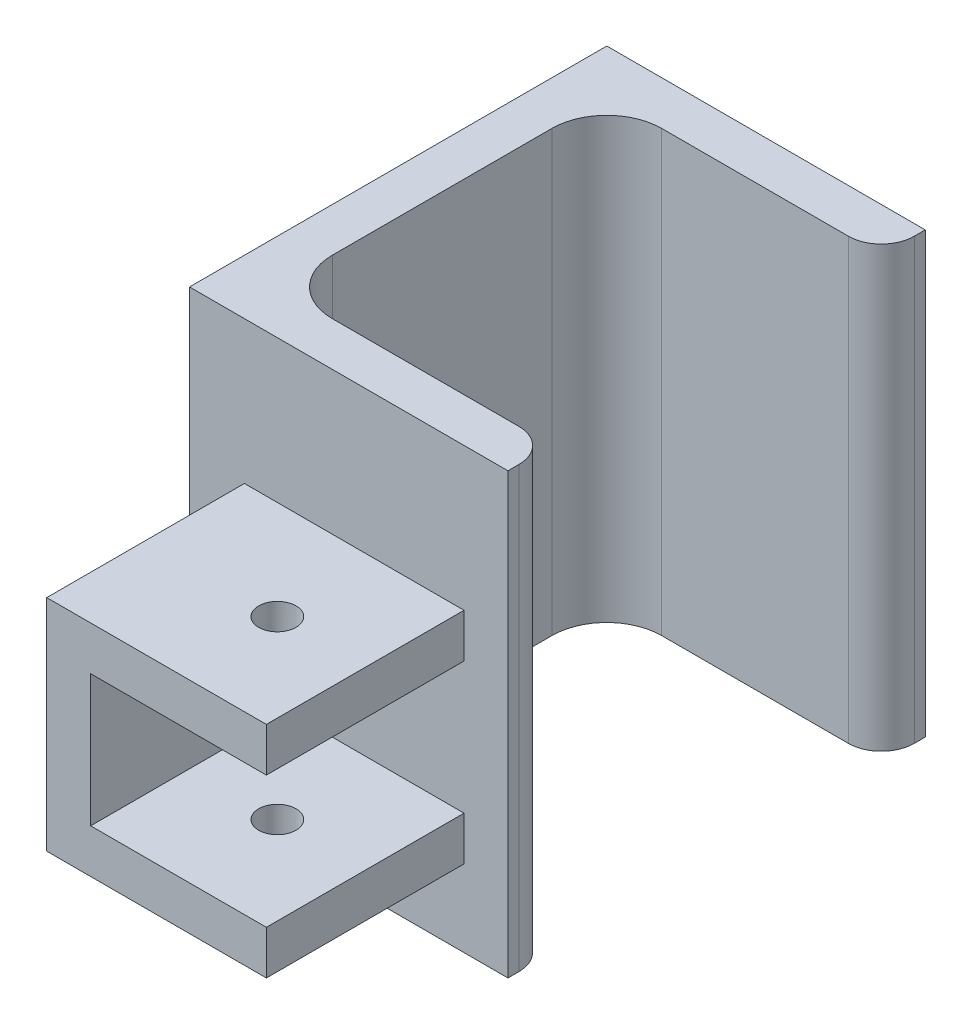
ISO-10303-21;
HEADER;
FILE_DESCRIPTION(('STEP AP214'),'2;1');
FILE_NAME('part.step','',(''),(''),'','','');
FILE_SCHEMA(('AUTOMOTIVE_DESIGN { 1 0 10303 214 1 1 1 1 }'));
ENDSEC;
DATA;
#1=APPLICATION_CONTEXT('core data for automotive mechanical design processes');
#2=APPLICATION_PROTOCOL_DEFINITION('international standard','automotive_design',2000,#1);
#3=PRODUCT_CONTEXT('',#1,'mechanical');
#4=PRODUCT('Part','Part','',(#3));
#5=PRODUCT_RELATED_PRODUCT_CATEGORY('part','',(#4));
#6=PRODUCT_DEFINITION_FORMATION('','',#4);
#7=PRODUCT_DEFINITION_CONTEXT('part definition',#1,'design');
#8=PRODUCT_DEFINITION('design','',#6,#7);
#9=PRODUCT_DEFINITION_SHAPE('','',#8);
#10=(LENGTH_UNIT() NAMED_UNIT(*) SI_UNIT(.MILLI.,.METRE.));
#11=(NAMED_UNIT(*) PLANE_ANGLE_UNIT() SI_UNIT($,.RADIAN.));
#12=(NAMED_UNIT(*) SI_UNIT($,.STERADIAN.) SOLID_ANGLE_UNIT());
#13=UNCERTAINTY_MEASURE_WITH_UNIT(LENGTH_MEASURE(1.E-05),#10,'distance_accuracy_value','');
#14=(GEOMETRIC_REPRESENTATION_CONTEXT(3) GLOBAL_UNCERTAINTY_ASSIGNED_CONTEXT((#13)) GLOBAL_UNIT_ASSIGNED_CONTEXT((#10,
#11,#12)) REPRESENTATION_CONTEXT('',''));
#15=CARTESIAN_POINT('',(0.,0.,0.));
#16=DIRECTION('',(0.,0.,1.));
#17=DIRECTION('',(1.,0.,0.));
#18=AXIS2_PLACEMENT_3D('',#15,#16,#17);
#19=CARTESIAN_POINT('',(25.,6.99999999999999,37.));
#20=DIRECTION('',(-1.,0.,0.));
#21=DIRECTION('',(0.,-1.,0.));
#22=AXIS2_PLACEMENT_3D('',#19,#20,#21);
#23=PLANE('',#22);
#24=DIRECTION('',(0.,0.,1.));
#25=VECTOR('',#24,1.);
#26=CARTESIAN_POINT('',(25.,2.99999999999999,19.));
#27=LINE('',#26,#25);
#28=CARTESIAN_POINT('',(25.,2.99999999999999,19.));
#29=VERTEX_POINT('',#28);
#30=CARTESIAN_POINT('',(25.,2.99999999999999,37.));
#31=VERTEX_POINT('',#30);
#32=EDGE_CURVE('E214',#29,#31,#27,.T.);
#33=ORIENTED_EDGE('',*,*,#32,.F.);
#34=DIRECTION('',(0.,1.,0.));
#35=VECTOR('',#34,1.);
#36=CARTESIAN_POINT('',(25.,6.99999999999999,19.));
#37=LINE('',#36,#35);
#38=CARTESIAN_POINT('',(25.,6.99999999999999,19.));
#39=VERTEX_POINT('',#38);
#40=EDGE_CURVE('E233',#29,#39,#37,.T.);
#41=ORIENTED_EDGE('',*,*,#40,.T.);
#42=DIRECTION('',(0.,0.,-1.));
#43=VECTOR('',#42,1.);
#44=CARTESIAN_POINT('',(25.,6.99999999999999,37.));
#45=LINE('',#44,#43);
#46=CARTESIAN_POINT('',(25.,6.99999999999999,37.));
#47=VERTEX_POINT('',#46);
#48=EDGE_CURVE('E240',#47,#39,#45,.T.);
#49=ORIENTED_EDGE('',*,*,#48,.F.);
#50=DIRECTION('',(0.,1.,0.));
#51=VECTOR('',#50,1.);
#52=CARTESIAN_POINT('',(25.,6.99999999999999,37.));
#53=LINE('',#52,#51);
#54=EDGE_CURVE('E219',#31,#47,#53,.T.);
#55=ORIENTED_EDGE('',*,*,#54,.F.);
#56=EDGE_LOOP('',(#33,#41,#49,#55));
#57=FACE_BOUND('',#56,.T.);
#58=ADVANCED_FACE('F39',(#57),#23,.F.);
#59=CARTESIAN_POINT('',(4.,20.,15.));
#60=DIRECTION('',(0.,-1.,0.));
#61=DIRECTION('',(0.,0.,-1.));
#62=AXIS2_PLACEMENT_3D('',#59,#60,#61);
#63=PLANE('',#62);
#64=DIRECTION('',(0.,0.,-1.));
#65=VECTOR('',#64,1.);
#66=CARTESIAN_POINT('',(29.,20.,19.));
#67=LINE('',#66,#65);
#68=CARTESIAN_POINT('',(29.,20.,19.));
#69=VERTEX_POINT('',#68);
#70=CARTESIAN_POINT('',(29.,20.,18.));
#71=VERTEX_POINT('',#70);
#72=EDGE_CURVE('E278',#69,#71,#67,.T.);
#73=ORIENTED_EDGE('',*,*,#72,.T.);
#74=CARTESIAN_POINT('',(26.,20.,18.));
#75=DIRECTION('',(0.,-1.,0.));
#76=DIRECTION('',(0.,0.,-1.));
#77=AXIS2_PLACEMENT_3D('',#74,#75,#76);
#78=CIRCLE('',#77,3.);
#79=CARTESIAN_POINT('',(26.,20.,15.));
#80=VERTEX_POINT('',#79);
#81=EDGE_CURVE('E325',#71,#80,#78,.F.);
#82=ORIENTED_EDGE('',*,*,#81,.T.);
#83=DIRECTION('',(-1.,0.,0.));
#84=VECTOR('',#83,1.);
#85=CARTESIAN_POINT('',(0.,20.,15.));
#86=LINE('',#85,#84);
#87=CARTESIAN_POINT('',(9.,20.,15.));
#88=VERTEX_POINT('',#87);
#89=EDGE_CURVE('E275',#80,#88,#86,.T.);
#90=ORIENTED_EDGE('',*,*,#89,.T.);
#91=CARTESIAN_POINT('',(9.,20.,9.99999999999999));
#92=DIRECTION('',(0.,-1.,0.));
#93=DIRECTION('',(0.,0.,-1.));
#94=AXIS2_PLACEMENT_3D('',#91,#92,#93);
#95=CIRCLE('',#94,5.);
#96=CARTESIAN_POINT('',(4.,20.,9.99999999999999));
#97=VERTEX_POINT('',#96);
#98=EDGE_CURVE('E315',#88,#97,#95,.T.);
#99=ORIENTED_EDGE('',*,*,#98,.T.);
#100=DIRECTION('',(0.,0.,1.));
#101=VECTOR('',#100,1.);
#102=CARTESIAN_POINT('',(4.,20.,15.));
#103=LINE('',#102,#101);
#104=CARTESIAN_POINT('',(4.,20.,-10.));
#105=VERTEX_POINT('',#104);
#106=EDGE_CURVE('E287',#105,#97,#103,.T.);
#107=ORIENTED_EDGE('',*,*,#106,.F.);
#108=CARTESIAN_POINT('',(9.,20.,-10.));
#109=DIRECTION('',(0.,-1.,0.));
#110=DIRECTION('',(0.,0.,-1.));
#111=AXIS2_PLACEMENT_3D('',#108,#109,#110);
#112=CIRCLE('',#111,5.);
#113=CARTESIAN_POINT('',(9.,20.,-15.));
#114=VERTEX_POINT('',#113);
#115=EDGE_CURVE('E313',#105,#114,#112,.T.);
#116=ORIENTED_EDGE('',*,*,#115,.T.);
#117=DIRECTION('',(1.,0.,0.));
#118=VECTOR('',#117,1.);
#119=CARTESIAN_POINT('',(0.,20.,-15.));
#120=LINE('',#119,#118);
#121=CARTESIAN_POINT('',(26.,20.,-15.));
#122=VERTEX_POINT('',#121);
#123=EDGE_CURVE('E246',#114,#122,#120,.T.);
#124=ORIENTED_EDGE('',*,*,#123,.T.);
#125=CARTESIAN_POINT('',(26.,20.,-18.));
#126=DIRECTION('',(0.,-1.,0.));
#127=DIRECTION('',(0.,0.,-1.));
#128=AXIS2_PLACEMENT_3D('',#125,#126,#127);
#129=CIRCLE('',#128,3.);
#130=CARTESIAN_POINT('',(29.,20.,-18.));
#131=VERTEX_POINT('',#130);
#132=EDGE_CURVE('E324',#122,#131,#129,.F.);
#133=ORIENTED_EDGE('',*,*,#132,.T.);
#134=DIRECTION('',(0.,0.,1.));
#135=VECTOR('',#134,1.);
#136=CARTESIAN_POINT('',(29.,20.,-19.));
#137=LINE('',#136,#135);
#138=CARTESIAN_POINT('',(29.,20.,-19.));
#139=VERTEX_POINT('',#138);
#140=EDGE_CURVE('E262',#139,#131,#137,.T.);
#141=ORIENTED_EDGE('',*,*,#140,.F.);
#142=DIRECTION('',(1.,0.,0.));
#143=VECTOR('',#142,1.);
#144=CARTESIAN_POINT('',(0.,20.,-19.));
#145=LINE('',#144,#143);
#146=CARTESIAN_POINT('',(0.,20.,-19.));
#147=VERTEX_POINT('',#146);
#148=EDGE_CURVE('E249',#147,#139,#145,.T.);
#149=ORIENTED_EDGE('',*,*,#148,.F.);
#150=DIRECTION('',(0.,0.,1.));
#151=VECTOR('',#150,1.);
#152=CARTESIAN_POINT('',(0.,20.,15.));
#153=LINE('',#152,#151);
#154=CARTESIAN_POINT('',(0.,20.,19.));
#155=VERTEX_POINT('',#154);
#156=EDGE_CURVE('E288',#147,#155,#153,.T.);
#157=ORIENTED_EDGE('',*,*,#156,.T.);
#158=DIRECTION('',(-1.,0.,0.));
#159=VECTOR('',#158,1.);
#160=CARTESIAN_POINT('',(0.,20.,19.));
#161=LINE('',#160,#159);
#162=EDGE_CURVE('E279',#69,#155,#161,.T.);
#163=ORIENTED_EDGE('',*,*,#162,.F.);
#164=EDGE_LOOP('',(#73,#82,#90,#99,#107,#116,#124,#133,#141,#149,#157,#163));
#165=FACE_BOUND('',#164,.T.);
#166=ADVANCED_FACE('F352',(#165),#63,.F.);
#167=CARTESIAN_POINT('',(4.,-20.,15.));
#168=DIRECTION('',(0.,1.,0.));
#169=DIRECTION('',(0.,0.,1.));
#170=AXIS2_PLACEMENT_3D('',#167,#168,#169);
#171=PLANE('',#170);
#172=DIRECTION('',(1.,0.,0.));
#173=VECTOR('',#172,1.);
#174=CARTESIAN_POINT('',(0.,-20.,15.));
#175=LINE('',#174,#173);
#176=CARTESIAN_POINT('',(9.,-20.,15.));
#177=VERTEX_POINT('',#176);
#178=CARTESIAN_POINT('',(26.,-20.,15.));
#179=VERTEX_POINT('',#178);
#180=EDGE_CURVE('E270',#177,#179,#175,.T.);
#181=ORIENTED_EDGE('',*,*,#180,.T.);
#182=CARTESIAN_POINT('',(26.,-20.,18.));
#183=DIRECTION('',(0.,1.,0.));
#184=DIRECTION('',(0.,0.,1.));
#185=AXIS2_PLACEMENT_3D('',#182,#183,#184);
#186=CIRCLE('',#185,3.);
#187=CARTESIAN_POINT('',(29.,-20.,18.));
#188=VERTEX_POINT('',#187);
#189=EDGE_CURVE('E327',#179,#188,#186,.F.);
#190=ORIENTED_EDGE('',*,*,#189,.T.);
#191=DIRECTION('',(0.,0.,-1.));
#192=VECTOR('',#191,1.);
#193=CARTESIAN_POINT('',(29.,-20.,19.));
#194=LINE('',#193,#192);
#195=CARTESIAN_POINT('',(29.,-20.,19.));
#196=VERTEX_POINT('',#195);
#197=EDGE_CURVE('E284',#196,#188,#194,.T.);
#198=ORIENTED_EDGE('',*,*,#197,.F.);
#199=DIRECTION('',(1.,0.,0.));
#200=VECTOR('',#199,1.);
#201=CARTESIAN_POINT('',(0.,-20.,19.));
#202=LINE('',#201,#200);
#203=CARTESIAN_POINT('',(0.,-20.,19.));
#204=VERTEX_POINT('',#203);
#205=EDGE_CURVE('E272',#204,#196,#202,.T.);
#206=ORIENTED_EDGE('',*,*,#205,.F.);
#207=DIRECTION('',(0.,0.,-1.));
#208=VECTOR('',#207,1.);
#209=CARTESIAN_POINT('',(0.,-20.,15.));
#210=LINE('',#209,#208);
#211=CARTESIAN_POINT('',(0.,-20.,-19.));
#212=VERTEX_POINT('',#211);
#213=EDGE_CURVE('E291',#204,#212,#210,.T.);
#214=ORIENTED_EDGE('',*,*,#213,.T.);
#215=DIRECTION('',(-1.,0.,0.));
#216=VECTOR('',#215,1.);
#217=CARTESIAN_POINT('',(0.,-20.,-19.));
#218=LINE('',#217,#216);
#219=CARTESIAN_POINT('',(29.,-20.,-19.));
#220=VERTEX_POINT('',#219);
#221=EDGE_CURVE('E253',#220,#212,#218,.T.);
#222=ORIENTED_EDGE('',*,*,#221,.F.);
#223=DIRECTION('',(0.,0.,1.));
#224=VECTOR('',#223,1.);
#225=CARTESIAN_POINT('',(29.,-20.,-19.));
#226=LINE('',#225,#224);
#227=CARTESIAN_POINT('',(29.,-20.,-18.));
#228=VERTEX_POINT('',#227);
#229=EDGE_CURVE('E260',#220,#228,#226,.T.);
#230=ORIENTED_EDGE('',*,*,#229,.T.);
#231=CARTESIAN_POINT('',(26.,-20.,-18.));
#232=DIRECTION('',(0.,1.,0.));
#233=DIRECTION('',(0.,0.,1.));
#234=AXIS2_PLACEMENT_3D('',#231,#232,#233);
#235=CIRCLE('',#234,3.);
#236=CARTESIAN_POINT('',(26.,-20.,-15.));
#237=VERTEX_POINT('',#236);
#238=EDGE_CURVE('E330',#228,#237,#235,.F.);
#239=ORIENTED_EDGE('',*,*,#238,.T.);
#240=DIRECTION('',(-1.,0.,0.));
#241=VECTOR('',#240,1.);
#242=CARTESIAN_POINT('',(0.,-20.,-15.));
#243=LINE('',#242,#241);
#244=CARTESIAN_POINT('',(9.,-20.,-15.));
#245=VERTEX_POINT('',#244);
#246=EDGE_CURVE('E252',#237,#245,#243,.T.);
#247=ORIENTED_EDGE('',*,*,#246,.T.);
#248=CARTESIAN_POINT('',(9.,-20.,-10.));
#249=DIRECTION('',(0.,1.,0.));
#250=DIRECTION('',(0.,0.,1.));
#251=AXIS2_PLACEMENT_3D('',#248,#249,#250);
#252=CIRCLE('',#251,5.);
#253=CARTESIAN_POINT('',(4.,-20.,-9.99999999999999));
#254=VERTEX_POINT('',#253);
#255=EDGE_CURVE('E317',#245,#254,#252,.T.);
#256=ORIENTED_EDGE('',*,*,#255,.T.);
#257=DIRECTION('',(0.,0.,-1.));
#258=VECTOR('',#257,1.);
#259=CARTESIAN_POINT('',(4.,-20.,15.));
#260=LINE('',#259,#258);
#261=CARTESIAN_POINT('',(4.,-20.,10.));
#262=VERTEX_POINT('',#261);
#263=EDGE_CURVE('E292',#262,#254,#260,.T.);
#264=ORIENTED_EDGE('',*,*,#263,.F.);
#265=CARTESIAN_POINT('',(9.,-20.,9.99999999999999));
#266=DIRECTION('',(0.,1.,0.));
#267=DIRECTION('',(0.,0.,1.));
#268=AXIS2_PLACEMENT_3D('',#265,#266,#267);
#269=CIRCLE('',#268,5.);
#270=EDGE_CURVE('E309',#262,#177,#269,.T.);
#271=ORIENTED_EDGE('',*,*,#270,.T.);
#272=EDGE_LOOP('',(#181,#190,#198,#206,#214,#222,#230,#239,#247,#256,#264,#271));
#273=FACE_BOUND('',#272,.T.);
#274=ADVANCED_FACE('F341',(#273),#171,.F.);
#275=CARTESIAN_POINT('',(4.,0.,0.));
#276=DIRECTION('',(1.,0.,0.));
#277=DIRECTION('',(0.,0.,-1.));
#278=AXIS2_PLACEMENT_3D('',#275,#276,#277);
#279=PLANE('',#278);
#280=ORIENTED_EDGE('',*,*,#106,.T.);
#281=DIRECTION('',(0.,-1.,0.));
#282=VECTOR('',#281,1.);
#283=CARTESIAN_POINT('',(4.,0.,9.99999999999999));
#284=LINE('',#283,#282);
#285=EDGE_CURVE('E301',#97,#262,#284,.T.);
#286=ORIENTED_EDGE('',*,*,#285,.T.);
#287=ORIENTED_EDGE('',*,*,#263,.T.);
#288=DIRECTION('',(0.,1.,0.));
#289=VECTOR('',#288,1.);
#290=CARTESIAN_POINT('',(4.,20.,-10.));
#291=LINE('',#290,#289);
#292=EDGE_CURVE('E298',#254,#105,#291,.T.);
#293=ORIENTED_EDGE('',*,*,#292,.T.);
#294=EDGE_LOOP('',(#280,#286,#287,#293));
#295=FACE_BOUND('',#294,.T.);
#296=ADVANCED_FACE('F362',(#295),#279,.T.);
#297=CARTESIAN_POINT('',(0.,0.,0.));
#298=DIRECTION('',(1.,0.,0.));
#299=DIRECTION('',(0.,0.,-1.));
#300=AXIS2_PLACEMENT_3D('',#297,#298,#299);
#301=PLANE('',#300);
#302=ORIENTED_EDGE('',*,*,#156,.F.);
#303=DIRECTION('',(0.,1.,0.));
#304=VECTOR('',#303,1.);
#305=CARTESIAN_POINT('',(0.,20.,-19.));
#306=LINE('',#305,#304);
#307=EDGE_CURVE('E250',#212,#147,#306,.T.);
#308=ORIENTED_EDGE('',*,*,#307,.F.);
#309=ORIENTED_EDGE('',*,*,#213,.F.);
#310=DIRECTION('',(0.,-1.,0.));
#311=VECTOR('',#310,1.);
#312=CARTESIAN_POINT('',(0.,20.,19.));
#313=LINE('',#312,#311);
#314=EDGE_CURVE('E268',#155,#204,#313,.T.);
#315=ORIENTED_EDGE('',*,*,#314,.F.);
#316=EDGE_LOOP('',(#302,#308,#309,#315));
#317=FACE_BOUND('',#316,.T.);
#318=ADVANCED_FACE('F347',(#317),#301,.F.);
#319=CARTESIAN_POINT('',(29.,20.,19.));
#320=DIRECTION('',(-1.,0.,0.));
#321=DIRECTION('',(0.,-1.,0.));
#322=AXIS2_PLACEMENT_3D('',#319,#320,#321);
#323=PLANE('',#322);
#324=ORIENTED_EDGE('',*,*,#197,.T.);
#325=DIRECTION('',(0.,1.,0.));
#326=VECTOR('',#325,1.);
#327=CARTESIAN_POINT('',(29.,20.,18.));
#328=LINE('',#327,#326);
#329=EDGE_CURVE('E319',#188,#71,#328,.T.);
#330=ORIENTED_EDGE('',*,*,#329,.T.);
#331=ORIENTED_EDGE('',*,*,#72,.F.);
#332=DIRECTION('',(0.,1.,0.));
#333=VECTOR('',#332,1.);
#334=CARTESIAN_POINT('',(29.,20.,19.));
#335=LINE('',#334,#333);
#336=EDGE_CURVE('E274',#196,#69,#335,.T.);
#337=ORIENTED_EDGE('',*,*,#336,.F.);
#338=EDGE_LOOP('',(#324,#330,#331,#337));
#339=FACE_BOUND('',#338,.T.);
#340=ADVANCED_FACE('F383',(#339),#323,.F.);
#341=CARTESIAN_POINT('',(0.,0.,19.));
#342=DIRECTION('',(0.,0.,1.));
#343=DIRECTION('',(1.,0.,0.));
#344=AXIS2_PLACEMENT_3D('',#341,#342,#343);
#345=PLANE('',#344);
#346=DIRECTION('',(0.,-1.,0.));
#347=VECTOR('',#346,1.);
#348=CARTESIAN_POINT('',(5.,6.99999999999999,19.));
#349=LINE('',#348,#347);
#350=CARTESIAN_POINT('',(5.,6.99999999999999,19.));
#351=VERTEX_POINT('',#350);
#352=CARTESIAN_POINT('',(5.,-13.,19.));
#353=VERTEX_POINT('',#352);
#354=EDGE_CURVE('E65',#351,#353,#349,.T.);
#355=ORIENTED_EDGE('',*,*,#354,.F.);
#356=DIRECTION('',(-1.,0.,0.));
#357=VECTOR('',#356,1.);
#358=CARTESIAN_POINT('',(5.,6.99999999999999,19.));
#359=LINE('',#358,#357);
#360=EDGE_CURVE('E218',#39,#351,#359,.T.);
#361=ORIENTED_EDGE('',*,*,#360,.F.);
#362=ORIENTED_EDGE('',*,*,#40,.F.);
#363=DIRECTION('',(-1.,0.,0.));
#364=VECTOR('',#363,1.);
#365=CARTESIAN_POINT('',(9.,2.99999999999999,19.));
#366=LINE('',#365,#364);
#367=CARTESIAN_POINT('',(9.,2.99999999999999,19.));
#368=VERTEX_POINT('',#367);
#369=EDGE_CURVE('E189',#29,#368,#366,.T.);
#370=ORIENTED_EDGE('',*,*,#369,.T.);
#371=DIRECTION('',(0.,-1.,0.));
#372=VECTOR('',#371,1.);
#373=CARTESIAN_POINT('',(9.,2.99999999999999,19.));
#374=LINE('',#373,#372);
#375=CARTESIAN_POINT('',(9.,-9.00000000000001,19.));
#376=VERTEX_POINT('',#375);
#377=EDGE_CURVE('E181',#368,#376,#374,.T.);
#378=ORIENTED_EDGE('',*,*,#377,.T.);
#379=DIRECTION('',(1.,0.,0.));
#380=VECTOR('',#379,1.);
#381=CARTESIAN_POINT('',(9.,-9.00000000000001,19.));
#382=LINE('',#381,#380);
#383=CARTESIAN_POINT('',(25.,-9.00000000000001,19.));
#384=VERTEX_POINT('',#383);
#385=EDGE_CURVE('E194',#376,#384,#382,.T.);
#386=ORIENTED_EDGE('',*,*,#385,.T.);
#387=CARTESIAN_POINT('',(25.,-13.,19.));
#388=VERTEX_POINT('',#387);
#389=EDGE_CURVE('E235',#388,#384,#37,.T.);
#390=ORIENTED_EDGE('',*,*,#389,.F.);
#391=DIRECTION('',(1.,0.,0.));
#392=VECTOR('',#391,1.);
#393=CARTESIAN_POINT('',(5.,-13.,19.));
#394=LINE('',#393,#392);
#395=EDGE_CURVE('E226',#353,#388,#394,.T.);
#396=ORIENTED_EDGE('',*,*,#395,.F.);
#397=EDGE_LOOP('',(#355,#361,#362,#370,#378,#386,#390,#396));
#398=FACE_BOUND('',#397,.T.);
#399=ORIENTED_EDGE('',*,*,#314,.T.);
#400=ORIENTED_EDGE('',*,*,#205,.T.);
#401=ORIENTED_EDGE('',*,*,#336,.T.);
#402=ORIENTED_EDGE('',*,*,#162,.T.);
#403=EDGE_LOOP('',(#399,#400,#401,#402));
#404=FACE_BOUND('',#403,.T.);
#405=ADVANCED_FACE('F196',(#398,#404),#345,.T.);
#406=CARTESIAN_POINT('',(0.,0.,15.));
#407=DIRECTION('',(0.,0.,1.));
#408=DIRECTION('',(1.,0.,0.));
#409=AXIS2_PLACEMENT_3D('',#406,#407,#408);
#410=PLANE('',#409);
#411=ORIENTED_EDGE('',*,*,#89,.F.);
#412=DIRECTION('',(0.,1.,0.));
#413=VECTOR('',#412,1.);
#414=CARTESIAN_POINT('',(26.,0.,15.));
#415=LINE('',#414,#413);
#416=EDGE_CURVE('E322',#80,#179,#415,.F.);
#417=ORIENTED_EDGE('',*,*,#416,.T.);
#418=ORIENTED_EDGE('',*,*,#180,.F.);
#419=DIRECTION('',(0.,-1.,0.));
#420=VECTOR('',#419,1.);
#421=CARTESIAN_POINT('',(9.,0.,15.));
#422=LINE('',#421,#420);
#423=EDGE_CURVE('E302',#177,#88,#422,.F.);
#424=ORIENTED_EDGE('',*,*,#423,.T.);
#425=EDGE_LOOP('',(#411,#417,#418,#424));
#426=FACE_BOUND('',#425,.T.);
#427=ADVANCED_FACE('F380',(#426),#410,.F.);
#428=CARTESIAN_POINT('',(0.,0.,-15.));
#429=DIRECTION('',(0.,0.,1.));
#430=DIRECTION('',(0.,-1.,0.));
#431=AXIS2_PLACEMENT_3D('',#428,#429,#430);
#432=PLANE('',#431);
#433=ORIENTED_EDGE('',*,*,#246,.F.);
#434=DIRECTION('',(0.,-1.,0.));
#435=VECTOR('',#434,1.);
#436=CARTESIAN_POINT('',(26.,20.,-15.));
#437=LINE('',#436,#435);
#438=EDGE_CURVE('E11',#237,#122,#437,.F.);
#439=ORIENTED_EDGE('',*,*,#438,.T.);
#440=ORIENTED_EDGE('',*,*,#123,.F.);
#441=DIRECTION('',(0.,1.,0.));
#442=VECTOR('',#441,1.);
#443=CARTESIAN_POINT('',(9.,-20.,-15.));
#444=LINE('',#443,#442);
#445=EDGE_CURVE('E310',#114,#245,#444,.F.);
#446=ORIENTED_EDGE('',*,*,#445,.T.);
#447=EDGE_LOOP('',(#433,#439,#440,#446));
#448=FACE_BOUND('',#447,.T.);
#449=ADVANCED_FACE('F356',(#448),#432,.T.);
#450=CARTESIAN_POINT('',(29.,20.,-19.));
#451=DIRECTION('',(-1.,0.,0.));
#452=DIRECTION('',(0.,0.,1.));
#453=AXIS2_PLACEMENT_3D('',#450,#451,#452);
#454=PLANE('',#453);
#455=ORIENTED_EDGE('',*,*,#140,.T.);
#456=DIRECTION('',(0.,-1.,0.));
#457=VECTOR('',#456,1.);
#458=CARTESIAN_POINT('',(29.,-20.,-18.));
#459=LINE('',#458,#457);
#460=EDGE_CURVE('E48',#131,#228,#459,.T.);
#461=ORIENTED_EDGE('',*,*,#460,.T.);
#462=ORIENTED_EDGE('',*,*,#229,.F.);
#463=DIRECTION('',(0.,-1.,0.));
#464=VECTOR('',#463,1.);
#465=CARTESIAN_POINT('',(29.,20.,-19.));
#466=LINE('',#465,#464);
#467=EDGE_CURVE('E254',#139,#220,#466,.T.);
#468=ORIENTED_EDGE('',*,*,#467,.F.);
#469=EDGE_LOOP('',(#455,#461,#462,#468));
#470=FACE_BOUND('',#469,.T.);
#471=ADVANCED_FACE('F334',(#470),#454,.F.);
#472=CARTESIAN_POINT('',(0.,0.,-19.));
#473=DIRECTION('',(0.,0.,1.));
#474=DIRECTION('',(0.,-1.,0.));
#475=AXIS2_PLACEMENT_3D('',#472,#473,#474);
#476=PLANE('',#475);
#477=ORIENTED_EDGE('',*,*,#307,.T.);
#478=ORIENTED_EDGE('',*,*,#148,.T.);
#479=ORIENTED_EDGE('',*,*,#467,.T.);
#480=ORIENTED_EDGE('',*,*,#221,.T.);
#481=EDGE_LOOP('',(#477,#478,#479,#480));
#482=FACE_BOUND('',#481,.T.);
#483=ADVANCED_FACE('F350',(#482),#476,.F.);
#484=CARTESIAN_POINT('',(9.,0.,9.99999999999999));
#485=DIRECTION('',(0.,-1.,0.));
#486=DIRECTION('',(0.,0.,-1.));
#487=AXIS2_PLACEMENT_3D('',#484,#485,#486);
#488=CYLINDRICAL_SURFACE('',#487,5.);
#489=ORIENTED_EDGE('',*,*,#98,.F.);
#490=ORIENTED_EDGE('',*,*,#423,.F.);
#491=ORIENTED_EDGE('',*,*,#270,.F.);
#492=ORIENTED_EDGE('',*,*,#285,.F.);
#493=EDGE_LOOP('',(#489,#490,#491,#492));
#494=FACE_BOUND('',#493,.T.);
#495=ADVANCED_FACE('F371',(#494),#488,.F.);
#496=CARTESIAN_POINT('',(9.,0.,-10.));
#497=DIRECTION('',(0.,-1.,0.));
#498=DIRECTION('',(0.,0.,-1.));
#499=AXIS2_PLACEMENT_3D('',#496,#497,#498);
#500=CYLINDRICAL_SURFACE('',#499,5.);
#501=ORIENTED_EDGE('',*,*,#255,.F.);
#502=ORIENTED_EDGE('',*,*,#445,.F.);
#503=ORIENTED_EDGE('',*,*,#115,.F.);
#504=ORIENTED_EDGE('',*,*,#292,.F.);
#505=EDGE_LOOP('',(#501,#502,#503,#504));
#506=FACE_BOUND('',#505,.T.);
#507=ADVANCED_FACE('F368',(#506),#500,.F.);
#508=CARTESIAN_POINT('',(26.,20.,18.));
#509=DIRECTION('',(0.,1.,0.));
#510=DIRECTION('',(-1.,0.,0.));
#511=AXIS2_PLACEMENT_3D('',#508,#509,#510);
#512=CYLINDRICAL_SURFACE('',#511,3.);
#513=ORIENTED_EDGE('',*,*,#189,.F.);
#514=ORIENTED_EDGE('',*,*,#416,.F.);
#515=ORIENTED_EDGE('',*,*,#81,.F.);
#516=ORIENTED_EDGE('',*,*,#329,.F.);
#517=EDGE_LOOP('',(#513,#514,#515,#516));
#518=FACE_BOUND('',#517,.T.);
#519=ADVANCED_FACE('F379',(#518),#512,.T.);
#520=CARTESIAN_POINT('',(26.,20.,-18.));
#521=DIRECTION('',(0.,1.,0.));
#522=DIRECTION('',(0.,0.,1.));
#523=AXIS2_PLACEMENT_3D('',#520,#521,#522);
#524=CYLINDRICAL_SURFACE('',#523,3.);
#525=ORIENTED_EDGE('',*,*,#132,.F.);
#526=ORIENTED_EDGE('',*,*,#438,.F.);
#527=ORIENTED_EDGE('',*,*,#238,.F.);
#528=ORIENTED_EDGE('',*,*,#460,.F.);
#529=EDGE_LOOP('',(#525,#526,#527,#528));
#530=FACE_BOUND('',#529,.T.);
#531=ADVANCED_FACE('F41',(#530),#524,.T.);
#532=CARTESIAN_POINT('',(5.,6.99999999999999,37.));
#533=DIRECTION('',(1.,0.,0.));
#534=DIRECTION('',(0.,1.,0.));
#535=AXIS2_PLACEMENT_3D('',#532,#533,#534);
#536=PLANE('',#535);
#537=ORIENTED_EDGE('',*,*,#354,.T.);
#538=DIRECTION('',(0.,0.,-1.));
#539=VECTOR('',#538,1.);
#540=CARTESIAN_POINT('',(5.,-13.,37.));
#541=LINE('',#540,#539);
#542=CARTESIAN_POINT('',(5.,-13.,37.));
#543=VERTEX_POINT('',#542);
#544=EDGE_CURVE('E243',#543,#353,#541,.T.);
#545=ORIENTED_EDGE('',*,*,#544,.F.);
#546=DIRECTION('',(0.,-1.,0.));
#547=VECTOR('',#546,1.);
#548=CARTESIAN_POINT('',(5.,6.99999999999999,37.));
#549=LINE('',#548,#547);
#550=CARTESIAN_POINT('',(5.,6.99999999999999,37.));
#551=VERTEX_POINT('',#550);
#552=EDGE_CURVE('E213',#551,#543,#549,.T.);
#553=ORIENTED_EDGE('',*,*,#552,.F.);
#554=DIRECTION('',(0.,0.,-1.));
#555=VECTOR('',#554,1.);
#556=CARTESIAN_POINT('',(5.,6.99999999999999,37.));
#557=LINE('',#556,#555);
#558=EDGE_CURVE('E228',#551,#351,#557,.T.);
#559=ORIENTED_EDGE('',*,*,#558,.T.);
#560=EDGE_LOOP('',(#537,#545,#553,#559));
#561=FACE_BOUND('',#560,.T.);
#562=ADVANCED_FACE('F417',(#561),#536,.F.);
#563=CARTESIAN_POINT('',(5.,-13.,37.));
#564=DIRECTION('',(0.,1.,0.));
#565=DIRECTION('',(0.,0.,1.));
#566=AXIS2_PLACEMENT_3D('',#563,#564,#565);
#567=PLANE('',#566);
#568=CARTESIAN_POINT('',(17.,-13.,28.));
#569=DIRECTION('',(0.,-1.,0.));
#570=DIRECTION('',(0.,0.,-1.));
#571=AXIS2_PLACEMENT_3D('',#568,#569,#570);
#572=CIRCLE('',#571,1.7);
#573=CARTESIAN_POINT('',(17.,-13.,26.3));
#574=VERTEX_POINT('',#573);
#575=EDGE_CURVE('E461',#574,#574,#572,.T.);
#576=ORIENTED_EDGE('',*,*,#575,.F.);
#577=EDGE_LOOP('',(#576));
#578=FACE_BOUND('',#577,.T.);
#579=ORIENTED_EDGE('',*,*,#395,.T.);
#580=DIRECTION('',(0.,0.,-1.));
#581=VECTOR('',#580,1.);
#582=CARTESIAN_POINT('',(25.,-13.,37.));
#583=LINE('',#582,#581);
#584=CARTESIAN_POINT('',(25.,-13.,37.));
#585=VERTEX_POINT('',#584);
#586=EDGE_CURVE('E239',#585,#388,#583,.T.);
#587=ORIENTED_EDGE('',*,*,#586,.F.);
#588=DIRECTION('',(1.,0.,0.));
#589=VECTOR('',#588,1.);
#590=CARTESIAN_POINT('',(5.,-13.,37.));
#591=LINE('',#590,#589);
#592=EDGE_CURVE('E220',#543,#585,#591,.T.);
#593=ORIENTED_EDGE('',*,*,#592,.F.);
#594=ORIENTED_EDGE('',*,*,#544,.T.);
#595=EDGE_LOOP('',(#579,#587,#593,#594));
#596=FACE_BOUND('',#595,.T.);
#597=ADVANCED_FACE('F407',(#578,#596),#567,.F.);
#598=ORIENTED_EDGE('',*,*,#389,.T.);
#599=DIRECTION('',(0.,0.,1.));
#600=VECTOR('',#599,1.);
#601=CARTESIAN_POINT('',(25.,-9.00000000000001,19.));
#602=LINE('',#601,#600);
#603=CARTESIAN_POINT('',(25.,-9.00000000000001,37.));
#604=VERTEX_POINT('',#603);
#605=EDGE_CURVE('E190',#384,#604,#602,.T.);
#606=ORIENTED_EDGE('',*,*,#605,.T.);
#607=EDGE_CURVE('E221',#585,#604,#53,.T.);
#608=ORIENTED_EDGE('',*,*,#607,.F.);
#609=ORIENTED_EDGE('',*,*,#586,.T.);
#610=EDGE_LOOP('',(#598,#606,#608,#609));
#611=FACE_BOUND('',#610,.T.);
#612=ADVANCED_FACE('F399',(#611),#23,.F.);
#613=CARTESIAN_POINT('',(5.,6.99999999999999,37.));
#614=DIRECTION('',(0.,-1.,0.));
#615=DIRECTION('',(1.,0.,0.));
#616=AXIS2_PLACEMENT_3D('',#613,#614,#615);
#617=PLANE('',#616);
#618=CARTESIAN_POINT('',(17.,6.99999999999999,28.));
#619=DIRECTION('',(0.,-1.,0.));
#620=DIRECTION('',(1.,0.,0.));
#621=AXIS2_PLACEMENT_3D('',#618,#619,#620);
#622=CIRCLE('',#621,1.7);
#623=CARTESIAN_POINT('',(18.7,6.99999999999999,28.));
#624=VERTEX_POINT('',#623);
#625=EDGE_CURVE('E203',#624,#624,#622,.T.);
#626=ORIENTED_EDGE('',*,*,#625,.T.);
#627=EDGE_LOOP('',(#626));
#628=FACE_BOUND('',#627,.T.);
#629=ORIENTED_EDGE('',*,*,#360,.T.);
#630=ORIENTED_EDGE('',*,*,#558,.F.);
#631=DIRECTION('',(-1.,0.,0.));
#632=VECTOR('',#631,1.);
#633=CARTESIAN_POINT('',(5.,6.99999999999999,37.));
#634=LINE('',#633,#632);
#635=EDGE_CURVE('E222',#47,#551,#634,.T.);
#636=ORIENTED_EDGE('',*,*,#635,.F.);
#637=ORIENTED_EDGE('',*,*,#48,.T.);
#638=EDGE_LOOP('',(#629,#630,#636,#637));
#639=FACE_BOUND('',#638,.T.);
#640=ADVANCED_FACE('F408',(#628,#639),#617,.F.);
#641=CARTESIAN_POINT('',(0.,0.,37.));
#642=DIRECTION('',(0.,0.,1.));
#643=DIRECTION('',(1.,0.,0.));
#644=AXIS2_PLACEMENT_3D('',#641,#642,#643);
#645=PLANE('',#644);
#646=DIRECTION('',(1.,0.,0.));
#647=VECTOR('',#646,1.);
#648=CARTESIAN_POINT('',(9.,-9.00000000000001,37.));
#649=LINE('',#648,#647);
#650=CARTESIAN_POINT('',(9.,-9.00000000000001,37.));
#651=VERTEX_POINT('',#650);
#652=EDGE_CURVE('E199',#651,#604,#649,.T.);
#653=ORIENTED_EDGE('',*,*,#652,.F.);
#654=DIRECTION('',(0.,-1.,0.));
#655=VECTOR('',#654,1.);
#656=CARTESIAN_POINT('',(9.,2.99999999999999,37.));
#657=LINE('',#656,#655);
#658=CARTESIAN_POINT('',(9.,2.99999999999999,37.));
#659=VERTEX_POINT('',#658);
#660=EDGE_CURVE('E183',#659,#651,#657,.T.);
#661=ORIENTED_EDGE('',*,*,#660,.F.);
#662=DIRECTION('',(-1.,0.,0.));
#663=VECTOR('',#662,1.);
#664=CARTESIAN_POINT('',(9.,2.99999999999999,37.));
#665=LINE('',#664,#663);
#666=EDGE_CURVE('E54',#31,#659,#665,.T.);
#667=ORIENTED_EDGE('',*,*,#666,.F.);
#668=ORIENTED_EDGE('',*,*,#54,.T.);
#669=ORIENTED_EDGE('',*,*,#635,.T.);
#670=ORIENTED_EDGE('',*,*,#552,.T.);
#671=ORIENTED_EDGE('',*,*,#592,.T.);
#672=ORIENTED_EDGE('',*,*,#607,.T.);
#673=EDGE_LOOP('',(#653,#661,#667,#668,#669,#670,#671,#672));
#674=FACE_BOUND('',#673,.T.);
#675=ADVANCED_FACE('F416',(#674),#645,.T.);
#676=CARTESIAN_POINT('',(9.,2.99999999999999,19.));
#677=DIRECTION('',(-1.,0.,0.));
#678=DIRECTION('',(0.,-1.,0.));
#679=AXIS2_PLACEMENT_3D('',#676,#677,#678);
#680=PLANE('',#679);
#681=ORIENTED_EDGE('',*,*,#660,.T.);
#682=DIRECTION('',(0.,0.,1.));
#683=VECTOR('',#682,1.);
#684=CARTESIAN_POINT('',(9.,-9.00000000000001,19.));
#685=LINE('',#684,#683);
#686=EDGE_CURVE('E180',#376,#651,#685,.T.);
#687=ORIENTED_EDGE('',*,*,#686,.F.);
#688=ORIENTED_EDGE('',*,*,#377,.F.);
#689=DIRECTION('',(0.,0.,1.));
#690=VECTOR('',#689,1.);
#691=CARTESIAN_POINT('',(9.,2.99999999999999,19.));
#692=LINE('',#691,#690);
#693=EDGE_CURVE('E209',#368,#659,#692,.T.);
#694=ORIENTED_EDGE('',*,*,#693,.T.);
#695=EDGE_LOOP('',(#681,#687,#688,#694));
#696=FACE_BOUND('',#695,.T.);
#697=ADVANCED_FACE('F177',(#696),#680,.F.);
#698=CARTESIAN_POINT('',(9.,2.99999999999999,19.));
#699=DIRECTION('',(0.,1.,0.));
#700=DIRECTION('',(0.,0.,1.));
#701=AXIS2_PLACEMENT_3D('',#698,#699,#700);
#702=PLANE('',#701);
#703=CARTESIAN_POINT('',(17.,2.99999999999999,28.));
#704=DIRECTION('',(0.,1.,0.));
#705=DIRECTION('',(0.,0.,1.));
#706=AXIS2_PLACEMENT_3D('',#703,#704,#705);
#707=CIRCLE('',#706,1.7);
#708=CARTESIAN_POINT('',(17.,2.99999999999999,29.7));
#709=VERTEX_POINT('',#708);
#710=EDGE_CURVE('E460',#709,#709,#707,.T.);
#711=ORIENTED_EDGE('',*,*,#710,.T.);
#712=EDGE_LOOP('',(#711));
#713=FACE_BOUND('',#712,.T.);
#714=ORIENTED_EDGE('',*,*,#666,.T.);
#715=ORIENTED_EDGE('',*,*,#693,.F.);
#716=ORIENTED_EDGE('',*,*,#369,.F.);
#717=ORIENTED_EDGE('',*,*,#32,.T.);
#718=EDGE_LOOP('',(#714,#715,#716,#717));
#719=FACE_BOUND('',#718,.T.);
#720=ADVANCED_FACE('F435',(#713,#719),#702,.F.);
#721=CARTESIAN_POINT('',(9.,-9.00000000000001,19.));
#722=DIRECTION('',(0.,-1.,0.));
#723=DIRECTION('',(0.,0.,-1.));
#724=AXIS2_PLACEMENT_3D('',#721,#722,#723);
#725=PLANE('',#724);
#726=CARTESIAN_POINT('',(17.,-9.00000000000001,28.));
#727=DIRECTION('',(0.,-1.,0.));
#728=DIRECTION('',(0.,0.,-1.));
#729=AXIS2_PLACEMENT_3D('',#726,#727,#728);
#730=CIRCLE('',#729,1.7);
#731=CARTESIAN_POINT('',(17.,-9.00000000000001,26.3));
#732=VERTEX_POINT('',#731);
#733=EDGE_CURVE('E43',#732,#732,#730,.T.);
#734=ORIENTED_EDGE('',*,*,#733,.T.);
#735=EDGE_LOOP('',(#734));
#736=FACE_BOUND('',#735,.T.);
#737=ORIENTED_EDGE('',*,*,#652,.T.);
#738=ORIENTED_EDGE('',*,*,#605,.F.);
#739=ORIENTED_EDGE('',*,*,#385,.F.);
#740=ORIENTED_EDGE('',*,*,#686,.T.);
#741=EDGE_LOOP('',(#737,#738,#739,#740));
#742=FACE_BOUND('',#741,.T.);
#743=ADVANCED_FACE('F191',(#736,#742),#725,.F.);
#744=CARTESIAN_POINT('',(17.,20.,28.));
#745=DIRECTION('',(0.,-1.,0.));
#746=DIRECTION('',(0.,0.,-1.));
#747=AXIS2_PLACEMENT_3D('',#744,#745,#746);
#748=CYLINDRICAL_SURFACE('',#747,1.7);
#749=ORIENTED_EDGE('',*,*,#575,.T.);
#750=EDGE_LOOP('',(#749));
#751=FACE_BOUND('',#750,.T.);
#752=ORIENTED_EDGE('',*,*,#733,.F.);
#753=EDGE_LOOP('',(#752));
#754=FACE_BOUND('',#753,.T.);
#755=ADVANCED_FACE('F445',(#751,#754),#748,.F.);
#756=ORIENTED_EDGE('',*,*,#710,.F.);
#757=EDGE_LOOP('',(#756));
#758=FACE_BOUND('',#757,.T.);
#759=ORIENTED_EDGE('',*,*,#625,.F.);
#760=EDGE_LOOP('',(#759));
#761=FACE_BOUND('',#760,.T.);
#762=ADVANCED_FACE('F450',(#758,#761),#748,.F.);
#763=CLOSED_SHELL('',(#58,#166,#274,#296,#318,#340,#405,#427,#449,#471,#483,#495,#507,#519,#531,
#562,#597,#612,#640,#675,#697,#720,#743,#755,#762));
#764=MANIFOLD_SOLID_BREP('B2',#763);
#765=ADVANCED_BREP_SHAPE_REPRESENTATION('',(#18,#764),#14);
#766=SHAPE_DEFINITION_REPRESENTATION(#9,#765);
ENDSEC;
END-ISO-10303-21;
